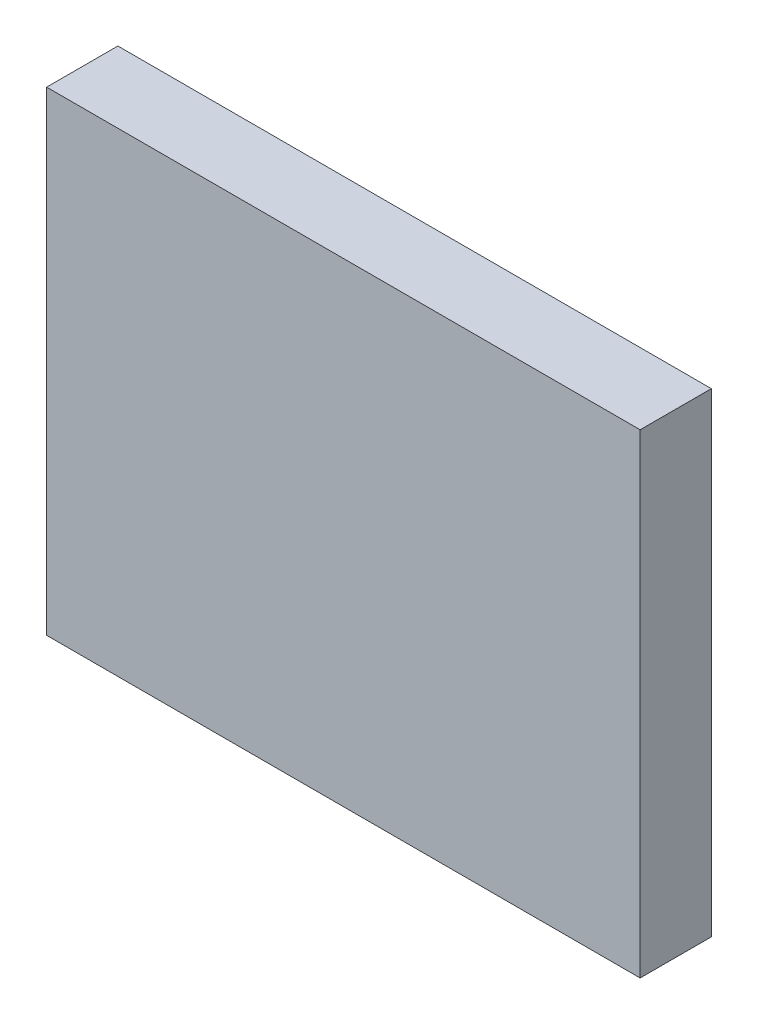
from build123d import *

# Parameters (mm, degrees)
SKETCH_1_W      = 50
SKETCH_1_H      = 40
EXTRUDE_2_DEPTH = 6


with BuildPart() as part:
    # Sketch 1 → Extrude 2 (new body)
    with BuildSketch(Plane.XY):
        with Locations((25, 20)):
            Rectangle(SKETCH_1_W, SKETCH_1_H)
    extrude(amount=EXTRUDE_2_DEPTH)


solid = part.part
